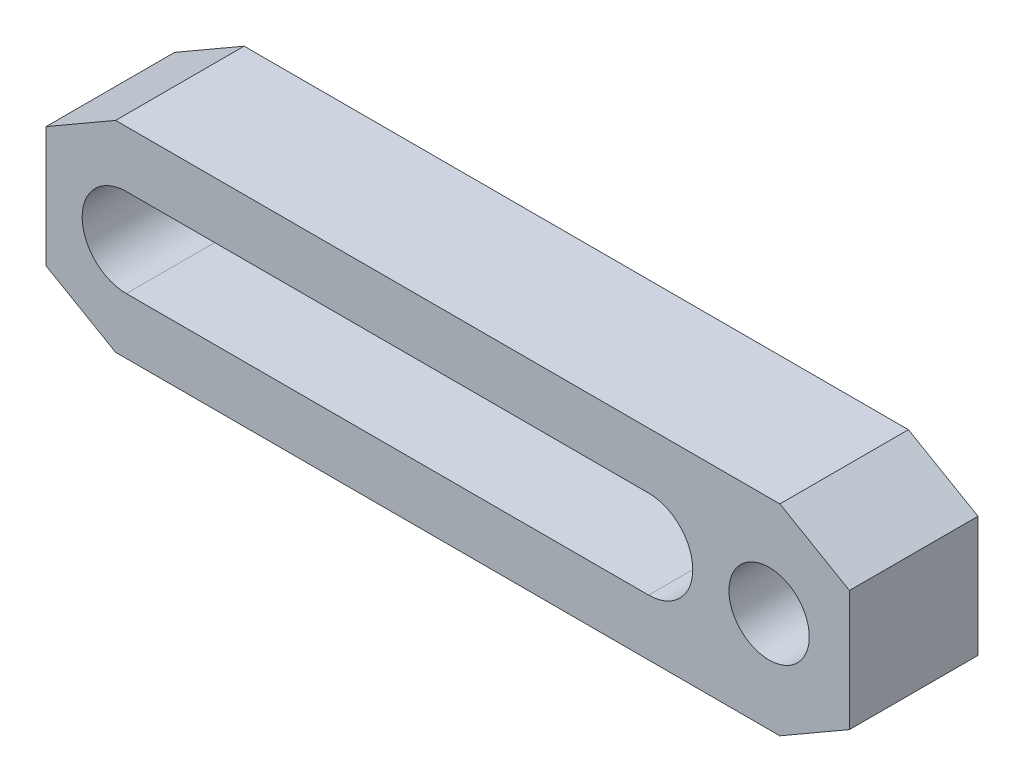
ISO-10303-21;
HEADER;
FILE_DESCRIPTION(('STEP AP214'),'2;1');
FILE_NAME('part.step','',(''),(''),'','','');
FILE_SCHEMA(('AUTOMOTIVE_DESIGN { 1 0 10303 214 1 1 1 1 }'));
ENDSEC;
DATA;
#1=APPLICATION_CONTEXT('core data for automotive mechanical design processes');
#2=APPLICATION_PROTOCOL_DEFINITION('international standard','automotive_design',2000,#1);
#3=PRODUCT_CONTEXT('',#1,'mechanical');
#4=PRODUCT('Part','Part','',(#3));
#5=PRODUCT_RELATED_PRODUCT_CATEGORY('part','',(#4));
#6=PRODUCT_DEFINITION_FORMATION('','',#4);
#7=PRODUCT_DEFINITION_CONTEXT('part definition',#1,'design');
#8=PRODUCT_DEFINITION('design','',#6,#7);
#9=PRODUCT_DEFINITION_SHAPE('','',#8);
#10=(LENGTH_UNIT() NAMED_UNIT(*) SI_UNIT(.MILLI.,.METRE.));
#11=(NAMED_UNIT(*) PLANE_ANGLE_UNIT() SI_UNIT($,.RADIAN.));
#12=(NAMED_UNIT(*) SI_UNIT($,.STERADIAN.) SOLID_ANGLE_UNIT());
#13=UNCERTAINTY_MEASURE_WITH_UNIT(LENGTH_MEASURE(1.E-05),#10,'distance_accuracy_value','');
#14=(GEOMETRIC_REPRESENTATION_CONTEXT(3) GLOBAL_UNCERTAINTY_ASSIGNED_CONTEXT((#13)) GLOBAL_UNIT_ASSIGNED_CONTEXT((#10,
#11,#12)) REPRESENTATION_CONTEXT('',''));
#15=CARTESIAN_POINT('',(0.,0.,0.));
#16=DIRECTION('',(0.,0.,1.));
#17=DIRECTION('',(1.,0.,0.));
#18=AXIS2_PLACEMENT_3D('',#15,#16,#17);
#19=CARTESIAN_POINT('',(-25.,36.3675134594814,16.));
#20=DIRECTION('',(0.,0.,1.));
#21=DIRECTION('',(0.,1.,0.));
#22=AXIS2_PLACEMENT_3D('',#19,#20,#21);
#23=PLANE('',#22);
#24=CARTESIAN_POINT('',(15.,0.,16.));
#25=DIRECTION('',(0.,0.,1.));
#26=DIRECTION('',(0.,1.,0.));
#27=AXIS2_PLACEMENT_3D('',#24,#25,#26);
#28=CIRCLE('',#27,5.);
#29=CARTESIAN_POINT('',(15.,5.,16.));
#30=VERTEX_POINT('',#29);
#31=EDGE_CURVE('E124',#30,#30,#28,.T.);
#32=ORIENTED_EDGE('',*,*,#31,.F.);
#33=EDGE_LOOP('',(#32));
#34=FACE_BOUND('',#33,.T.);
#35=DIRECTION('',(-0.866025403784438,-0.5,0.));
#36=VECTOR('',#35,1.);
#37=CARTESIAN_POINT('',(-75.,7.5,16.));
#38=LINE('',#37,#36);
#39=CARTESIAN_POINT('',(-66.3397459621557,12.5,16.));
#40=VERTEX_POINT('',#39);
#41=CARTESIAN_POINT('',(-75.,7.5,16.));
#42=VERTEX_POINT('',#41);
#43=EDGE_CURVE('E160',#40,#42,#38,.T.);
#44=ORIENTED_EDGE('',*,*,#43,.T.);
#45=DIRECTION('',(0.,-1.,0.));
#46=VECTOR('',#45,1.);
#47=CARTESIAN_POINT('',(-75.,-7.5,16.));
#48=LINE('',#47,#46);
#49=CARTESIAN_POINT('',(-75.,-7.5,16.));
#50=VERTEX_POINT('',#49);
#51=EDGE_CURVE('E163',#42,#50,#48,.T.);
#52=ORIENTED_EDGE('',*,*,#51,.T.);
#53=DIRECTION('',(0.866025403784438,-0.5,0.));
#54=VECTOR('',#53,1.);
#55=CARTESIAN_POINT('',(-75.,-7.5,16.));
#56=LINE('',#55,#54);
#57=CARTESIAN_POINT('',(-66.3397459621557,-12.5,16.));
#58=VERTEX_POINT('',#57);
#59=EDGE_CURVE('E165',#50,#58,#56,.T.);
#60=ORIENTED_EDGE('',*,*,#59,.T.);
#61=DIRECTION('',(1.,0.,0.));
#62=VECTOR('',#61,1.);
#63=CARTESIAN_POINT('',(16.3397459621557,-12.5,16.));
#64=LINE('',#63,#62);
#65=CARTESIAN_POINT('',(16.3397459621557,-12.5,16.));
#66=VERTEX_POINT('',#65);
#67=EDGE_CURVE('E167',#58,#66,#64,.T.);
#68=ORIENTED_EDGE('',*,*,#67,.T.);
#69=DIRECTION('',(0.866025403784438,0.5,0.));
#70=VECTOR('',#69,1.);
#71=CARTESIAN_POINT('',(25.,-7.5,16.));
#72=LINE('',#71,#70);
#73=CARTESIAN_POINT('',(25.,-7.5,16.));
#74=VERTEX_POINT('',#73);
#75=EDGE_CURVE('E169',#66,#74,#72,.T.);
#76=ORIENTED_EDGE('',*,*,#75,.T.);
#77=DIRECTION('',(0.,1.,0.));
#78=VECTOR('',#77,1.);
#79=CARTESIAN_POINT('',(25.,-7.5,16.));
#80=LINE('',#79,#78);
#81=CARTESIAN_POINT('',(25.,7.5,16.));
#82=VERTEX_POINT('',#81);
#83=EDGE_CURVE('E171',#74,#82,#80,.T.);
#84=ORIENTED_EDGE('',*,*,#83,.T.);
#85=DIRECTION('',(-0.866025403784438,0.5,0.));
#86=VECTOR('',#85,1.);
#87=CARTESIAN_POINT('',(25.,7.5,16.));
#88=LINE('',#87,#86);
#89=CARTESIAN_POINT('',(16.3397459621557,12.5,16.));
#90=VERTEX_POINT('',#89);
#91=EDGE_CURVE('E173',#82,#90,#88,.T.);
#92=ORIENTED_EDGE('',*,*,#91,.T.);
#93=DIRECTION('',(-1.,0.,0.));
#94=VECTOR('',#93,1.);
#95=CARTESIAN_POINT('',(16.3397459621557,12.5,16.));
#96=LINE('',#95,#94);
#97=EDGE_CURVE('E175',#90,#40,#96,.T.);
#98=ORIENTED_EDGE('',*,*,#97,.T.);
#99=EDGE_LOOP('',(#44,#52,#60,#68,#76,#84,#92,#98));
#100=FACE_BOUND('',#99,.T.);
#101=DIRECTION('',(-1.,0.,0.));
#102=VECTOR('',#101,1.);
#103=CARTESIAN_POINT('',(0.,5.5,16.));
#104=LINE('',#103,#102);
#105=CARTESIAN_POINT('',(0.,5.5,16.));
#106=VERTEX_POINT('',#105);
#107=CARTESIAN_POINT('',(-65.,5.5,16.));
#108=VERTEX_POINT('',#107);
#109=EDGE_CURVE('E134',#106,#108,#104,.T.);
#110=ORIENTED_EDGE('',*,*,#109,.F.);
#111=CARTESIAN_POINT('',(0.,0.,16.));
#112=DIRECTION('',(0.,0.,1.));
#113=DIRECTION('',(0.,1.,0.));
#114=AXIS2_PLACEMENT_3D('',#111,#112,#113);
#115=CIRCLE('',#114,5.5);
#116=CARTESIAN_POINT('',(0.,-5.5,16.));
#117=VERTEX_POINT('',#116);
#118=EDGE_CURVE('E118',#117,#106,#115,.T.);
#119=ORIENTED_EDGE('',*,*,#118,.F.);
#120=DIRECTION('',(1.,0.,0.));
#121=VECTOR('',#120,1.);
#122=CARTESIAN_POINT('',(0.,-5.5,16.));
#123=LINE('',#122,#121);
#124=CARTESIAN_POINT('',(-65.,-5.5,16.));
#125=VERTEX_POINT('',#124);
#126=EDGE_CURVE('E138',#125,#117,#123,.T.);
#127=ORIENTED_EDGE('',*,*,#126,.F.);
#128=CARTESIAN_POINT('',(-65.,0.,16.));
#129=DIRECTION('',(0.,0.,1.));
#130=DIRECTION('',(0.,1.,0.));
#131=AXIS2_PLACEMENT_3D('',#128,#129,#130);
#132=CIRCLE('',#131,5.5);
#133=EDGE_CURVE('E136',#108,#125,#132,.T.);
#134=ORIENTED_EDGE('',*,*,#133,.F.);
#135=EDGE_LOOP('',(#110,#119,#127,#134));
#136=FACE_BOUND('',#135,.T.);
#137=ADVANCED_FACE('F14',(#34,#100,#136),#23,.T.);
#138=CARTESIAN_POINT('',(-25.,36.3675134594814,0.));
#139=DIRECTION('',(0.,0.,1.));
#140=DIRECTION('',(0.,1.,0.));
#141=AXIS2_PLACEMENT_3D('',#138,#139,#140);
#142=PLANE('',#141);
#143=CARTESIAN_POINT('',(15.,0.,0.));
#144=DIRECTION('',(0.,0.,1.));
#145=DIRECTION('',(0.,1.,0.));
#146=AXIS2_PLACEMENT_3D('',#143,#144,#145);
#147=CIRCLE('',#146,5.);
#148=CARTESIAN_POINT('',(15.,5.,0.));
#149=VERTEX_POINT('',#148);
#150=EDGE_CURVE('E127',#149,#149,#147,.T.);
#151=ORIENTED_EDGE('',*,*,#150,.T.);
#152=EDGE_LOOP('',(#151));
#153=FACE_BOUND('',#152,.T.);
#154=DIRECTION('',(-0.866025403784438,-0.5,0.));
#155=VECTOR('',#154,1.);
#156=CARTESIAN_POINT('',(-75.,7.5,0.));
#157=LINE('',#156,#155);
#158=CARTESIAN_POINT('',(-66.3397459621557,12.5,0.));
#159=VERTEX_POINT('',#158);
#160=CARTESIAN_POINT('',(-75.,7.5,0.));
#161=VERTEX_POINT('',#160);
#162=EDGE_CURVE('E119',#159,#161,#157,.T.);
#163=ORIENTED_EDGE('',*,*,#162,.F.);
#164=DIRECTION('',(-1.,0.,0.));
#165=VECTOR('',#164,1.);
#166=CARTESIAN_POINT('',(16.3397459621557,12.5,0.));
#167=LINE('',#166,#165);
#168=CARTESIAN_POINT('',(16.3397459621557,12.5,0.));
#169=VERTEX_POINT('',#168);
#170=EDGE_CURVE('E158',#169,#159,#167,.T.);
#171=ORIENTED_EDGE('',*,*,#170,.F.);
#172=DIRECTION('',(-0.866025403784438,0.5,0.));
#173=VECTOR('',#172,1.);
#174=CARTESIAN_POINT('',(25.,7.5,0.));
#175=LINE('',#174,#173);
#176=CARTESIAN_POINT('',(25.,7.5,0.));
#177=VERTEX_POINT('',#176);
#178=EDGE_CURVE('E156',#177,#169,#175,.T.);
#179=ORIENTED_EDGE('',*,*,#178,.F.);
#180=DIRECTION('',(0.,1.,0.));
#181=VECTOR('',#180,1.);
#182=CARTESIAN_POINT('',(25.,-7.5,0.));
#183=LINE('',#182,#181);
#184=CARTESIAN_POINT('',(25.,-7.5,0.));
#185=VERTEX_POINT('',#184);
#186=EDGE_CURVE('E154',#185,#177,#183,.T.);
#187=ORIENTED_EDGE('',*,*,#186,.F.);
#188=DIRECTION('',(0.866025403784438,0.5,0.));
#189=VECTOR('',#188,1.);
#190=CARTESIAN_POINT('',(25.,-7.5,0.));
#191=LINE('',#190,#189);
#192=CARTESIAN_POINT('',(16.3397459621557,-12.5,0.));
#193=VERTEX_POINT('',#192);
#194=EDGE_CURVE('E152',#193,#185,#191,.T.);
#195=ORIENTED_EDGE('',*,*,#194,.F.);
#196=DIRECTION('',(1.,0.,0.));
#197=VECTOR('',#196,1.);
#198=CARTESIAN_POINT('',(16.3397459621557,-12.5,0.));
#199=LINE('',#198,#197);
#200=CARTESIAN_POINT('',(-66.3397459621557,-12.5,0.));
#201=VERTEX_POINT('',#200);
#202=EDGE_CURVE('E150',#201,#193,#199,.T.);
#203=ORIENTED_EDGE('',*,*,#202,.F.);
#204=DIRECTION('',(0.866025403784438,-0.5,0.));
#205=VECTOR('',#204,1.);
#206=CARTESIAN_POINT('',(-75.,-7.5,0.));
#207=LINE('',#206,#205);
#208=CARTESIAN_POINT('',(-75.,-7.5,0.));
#209=VERTEX_POINT('',#208);
#210=EDGE_CURVE('E148',#209,#201,#207,.T.);
#211=ORIENTED_EDGE('',*,*,#210,.F.);
#212=DIRECTION('',(0.,-1.,0.));
#213=VECTOR('',#212,1.);
#214=CARTESIAN_POINT('',(-75.,-7.5,0.));
#215=LINE('',#214,#213);
#216=EDGE_CURVE('E146',#161,#209,#215,.T.);
#217=ORIENTED_EDGE('',*,*,#216,.F.);
#218=EDGE_LOOP('',(#163,#171,#179,#187,#195,#203,#211,#217));
#219=FACE_BOUND('',#218,.T.);
#220=CARTESIAN_POINT('',(0.,0.,0.));
#221=DIRECTION('',(0.,0.,1.));
#222=DIRECTION('',(0.,1.,0.));
#223=AXIS2_PLACEMENT_3D('',#220,#221,#222);
#224=CIRCLE('',#223,5.5);
#225=CARTESIAN_POINT('',(0.,-5.5,0.));
#226=VERTEX_POINT('',#225);
#227=CARTESIAN_POINT('',(0.,5.5,0.));
#228=VERTEX_POINT('',#227);
#229=EDGE_CURVE('E37',#226,#228,#224,.T.);
#230=ORIENTED_EDGE('',*,*,#229,.T.);
#231=DIRECTION('',(-1.,0.,0.));
#232=VECTOR('',#231,1.);
#233=CARTESIAN_POINT('',(0.,5.5,0.));
#234=LINE('',#233,#232);
#235=CARTESIAN_POINT('',(-65.,5.5,0.));
#236=VERTEX_POINT('',#235);
#237=EDGE_CURVE('E105',#228,#236,#234,.T.);
#238=ORIENTED_EDGE('',*,*,#237,.T.);
#239=CARTESIAN_POINT('',(-65.,0.,0.));
#240=DIRECTION('',(0.,0.,1.));
#241=DIRECTION('',(0.,1.,0.));
#242=AXIS2_PLACEMENT_3D('',#239,#240,#241);
#243=CIRCLE('',#242,5.5);
#244=CARTESIAN_POINT('',(-65.,-5.5,0.));
#245=VERTEX_POINT('',#244);
#246=EDGE_CURVE('E114',#236,#245,#243,.T.);
#247=ORIENTED_EDGE('',*,*,#246,.T.);
#248=DIRECTION('',(1.,0.,0.));
#249=VECTOR('',#248,1.);
#250=CARTESIAN_POINT('',(0.,-5.5,0.));
#251=LINE('',#250,#249);
#252=EDGE_CURVE('E123',#245,#226,#251,.T.);
#253=ORIENTED_EDGE('',*,*,#252,.T.);
#254=EDGE_LOOP('',(#230,#238,#247,#253));
#255=FACE_BOUND('',#254,.T.);
#256=ADVANCED_FACE('F122',(#153,#219,#255),#142,.F.);
#257=CARTESIAN_POINT('',(-75.,7.5,16.));
#258=DIRECTION('',(0.5,-0.866025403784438,0.));
#259=DIRECTION('',(0.866025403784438,0.5,0.));
#260=AXIS2_PLACEMENT_3D('',#257,#258,#259);
#261=PLANE('',#260);
#262=ORIENTED_EDGE('',*,*,#162,.T.);
#263=DIRECTION('',(0.,0.,-1.));
#264=VECTOR('',#263,1.);
#265=CARTESIAN_POINT('',(-75.,7.5,16.));
#266=LINE('',#265,#264);
#267=EDGE_CURVE('E9',#42,#161,#266,.T.);
#268=ORIENTED_EDGE('',*,*,#267,.F.);
#269=ORIENTED_EDGE('',*,*,#43,.F.);
#270=DIRECTION('',(0.,0.,-1.));
#271=VECTOR('',#270,1.);
#272=CARTESIAN_POINT('',(-66.3397459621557,12.5,16.));
#273=LINE('',#272,#271);
#274=EDGE_CURVE('E177',#40,#159,#273,.T.);
#275=ORIENTED_EDGE('',*,*,#274,.T.);
#276=EDGE_LOOP('',(#262,#268,#269,#275));
#277=FACE_BOUND('',#276,.T.);
#278=ADVANCED_FACE('F16',(#277),#261,.F.);
#279=CARTESIAN_POINT('',(-75.,-7.5,16.));
#280=DIRECTION('',(1.,0.,0.));
#281=DIRECTION('',(0.,1.,0.));
#282=AXIS2_PLACEMENT_3D('',#279,#280,#281);
#283=PLANE('',#282);
#284=ORIENTED_EDGE('',*,*,#216,.T.);
#285=DIRECTION('',(0.,0.,-1.));
#286=VECTOR('',#285,1.);
#287=CARTESIAN_POINT('',(-75.,-7.5,16.));
#288=LINE('',#287,#286);
#289=EDGE_CURVE('E22',#50,#209,#288,.T.);
#290=ORIENTED_EDGE('',*,*,#289,.F.);
#291=ORIENTED_EDGE('',*,*,#51,.F.);
#292=ORIENTED_EDGE('',*,*,#267,.T.);
#293=EDGE_LOOP('',(#284,#290,#291,#292));
#294=FACE_BOUND('',#293,.T.);
#295=ADVANCED_FACE('F221',(#294),#283,.F.);
#296=CARTESIAN_POINT('',(-75.,-7.5,16.));
#297=DIRECTION('',(0.5,0.866025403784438,0.));
#298=DIRECTION('',(-0.866025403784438,0.5,0.));
#299=AXIS2_PLACEMENT_3D('',#296,#297,#298);
#300=PLANE('',#299);
#301=ORIENTED_EDGE('',*,*,#210,.T.);
#302=DIRECTION('',(0.,0.,-1.));
#303=VECTOR('',#302,1.);
#304=CARTESIAN_POINT('',(-66.3397459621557,-12.5,16.));
#305=LINE('',#304,#303);
#306=EDGE_CURVE('E192',#58,#201,#305,.T.);
#307=ORIENTED_EDGE('',*,*,#306,.F.);
#308=ORIENTED_EDGE('',*,*,#59,.F.);
#309=ORIENTED_EDGE('',*,*,#289,.T.);
#310=EDGE_LOOP('',(#301,#307,#308,#309));
#311=FACE_BOUND('',#310,.T.);
#312=ADVANCED_FACE('F199',(#311),#300,.F.);
#313=CARTESIAN_POINT('',(16.3397459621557,-12.5,16.));
#314=DIRECTION('',(0.,1.,0.));
#315=DIRECTION('',(-1.,0.,0.));
#316=AXIS2_PLACEMENT_3D('',#313,#314,#315);
#317=PLANE('',#316);
#318=ORIENTED_EDGE('',*,*,#202,.T.);
#319=DIRECTION('',(0.,0.,-1.));
#320=VECTOR('',#319,1.);
#321=CARTESIAN_POINT('',(16.3397459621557,-12.5,16.));
#322=LINE('',#321,#320);
#323=EDGE_CURVE('E189',#66,#193,#322,.T.);
#324=ORIENTED_EDGE('',*,*,#323,.F.);
#325=ORIENTED_EDGE('',*,*,#67,.F.);
#326=ORIENTED_EDGE('',*,*,#306,.T.);
#327=EDGE_LOOP('',(#318,#324,#325,#326));
#328=FACE_BOUND('',#327,.T.);
#329=ADVANCED_FACE('F209',(#328),#317,.F.);
#330=CARTESIAN_POINT('',(25.,-7.5,16.));
#331=DIRECTION('',(-0.5,0.866025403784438,0.));
#332=DIRECTION('',(-0.866025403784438,-0.5,0.));
#333=AXIS2_PLACEMENT_3D('',#330,#331,#332);
#334=PLANE('',#333);
#335=ORIENTED_EDGE('',*,*,#194,.T.);
#336=DIRECTION('',(0.,0.,-1.));
#337=VECTOR('',#336,1.);
#338=CARTESIAN_POINT('',(25.,-7.5,16.));
#339=LINE('',#338,#337);
#340=EDGE_CURVE('E186',#74,#185,#339,.T.);
#341=ORIENTED_EDGE('',*,*,#340,.F.);
#342=ORIENTED_EDGE('',*,*,#75,.F.);
#343=ORIENTED_EDGE('',*,*,#323,.T.);
#344=EDGE_LOOP('',(#335,#341,#342,#343));
#345=FACE_BOUND('',#344,.T.);
#346=ADVANCED_FACE('F213',(#345),#334,.F.);
#347=CARTESIAN_POINT('',(25.,-7.5,16.));
#348=DIRECTION('',(-1.,0.,0.));
#349=DIRECTION('',(0.,-1.,0.));
#350=AXIS2_PLACEMENT_3D('',#347,#348,#349);
#351=PLANE('',#350);
#352=ORIENTED_EDGE('',*,*,#186,.T.);
#353=DIRECTION('',(0.,0.,-1.));
#354=VECTOR('',#353,1.);
#355=CARTESIAN_POINT('',(25.,7.5,16.));
#356=LINE('',#355,#354);
#357=EDGE_CURVE('E183',#82,#177,#356,.T.);
#358=ORIENTED_EDGE('',*,*,#357,.F.);
#359=ORIENTED_EDGE('',*,*,#83,.F.);
#360=ORIENTED_EDGE('',*,*,#340,.T.);
#361=EDGE_LOOP('',(#352,#358,#359,#360));
#362=FACE_BOUND('',#361,.T.);
#363=ADVANCED_FACE('F234',(#362),#351,.F.);
#364=CARTESIAN_POINT('',(25.,7.5,16.));
#365=DIRECTION('',(-0.5,-0.866025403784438,0.));
#366=DIRECTION('',(0.866025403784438,-0.5,0.));
#367=AXIS2_PLACEMENT_3D('',#364,#365,#366);
#368=PLANE('',#367);
#369=ORIENTED_EDGE('',*,*,#178,.T.);
#370=DIRECTION('',(0.,0.,-1.));
#371=VECTOR('',#370,1.);
#372=CARTESIAN_POINT('',(16.3397459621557,12.5,16.));
#373=LINE('',#372,#371);
#374=EDGE_CURVE('E180',#90,#169,#373,.T.);
#375=ORIENTED_EDGE('',*,*,#374,.F.);
#376=ORIENTED_EDGE('',*,*,#91,.F.);
#377=ORIENTED_EDGE('',*,*,#357,.T.);
#378=EDGE_LOOP('',(#369,#375,#376,#377));
#379=FACE_BOUND('',#378,.T.);
#380=ADVANCED_FACE('F232',(#379),#368,.F.);
#381=CARTESIAN_POINT('',(16.3397459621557,12.5,16.));
#382=DIRECTION('',(0.,-1.,0.));
#383=DIRECTION('',(1.,0.,0.));
#384=AXIS2_PLACEMENT_3D('',#381,#382,#383);
#385=PLANE('',#384);
#386=ORIENTED_EDGE('',*,*,#170,.T.);
#387=ORIENTED_EDGE('',*,*,#274,.F.);
#388=ORIENTED_EDGE('',*,*,#97,.F.);
#389=ORIENTED_EDGE('',*,*,#374,.T.);
#390=EDGE_LOOP('',(#386,#387,#388,#389));
#391=FACE_BOUND('',#390,.T.);
#392=ADVANCED_FACE('F227',(#391),#385,.F.);
#393=CARTESIAN_POINT('',(0.,0.,16.));
#394=DIRECTION('',(0.,0.,-1.));
#395=DIRECTION('',(0.,-1.,0.));
#396=AXIS2_PLACEMENT_3D('',#393,#394,#395);
#397=CYLINDRICAL_SURFACE('',#396,5.5);
#398=ORIENTED_EDGE('',*,*,#229,.F.);
#399=DIRECTION('',(0.,0.,-1.));
#400=VECTOR('',#399,1.);
#401=CARTESIAN_POINT('',(0.,-5.5,16.));
#402=LINE('',#401,#400);
#403=EDGE_CURVE('E140',#117,#226,#402,.T.);
#404=ORIENTED_EDGE('',*,*,#403,.F.);
#405=ORIENTED_EDGE('',*,*,#118,.T.);
#406=DIRECTION('',(0.,0.,-1.));
#407=VECTOR('',#406,1.);
#408=CARTESIAN_POINT('',(0.,5.5,16.));
#409=LINE('',#408,#407);
#410=EDGE_CURVE('E107',#106,#228,#409,.T.);
#411=ORIENTED_EDGE('',*,*,#410,.T.);
#412=EDGE_LOOP('',(#398,#404,#405,#411));
#413=FACE_BOUND('',#412,.T.);
#414=ADVANCED_FACE('F116',(#413),#397,.F.);
#415=CARTESIAN_POINT('',(0.,5.5,16.));
#416=DIRECTION('',(0.,-1.,0.));
#417=DIRECTION('',(1.,0.,0.));
#418=AXIS2_PLACEMENT_3D('',#415,#416,#417);
#419=PLANE('',#418);
#420=ORIENTED_EDGE('',*,*,#237,.F.);
#421=ORIENTED_EDGE('',*,*,#410,.F.);
#422=ORIENTED_EDGE('',*,*,#109,.T.);
#423=DIRECTION('',(0.,0.,-1.));
#424=VECTOR('',#423,1.);
#425=CARTESIAN_POINT('',(-65.,5.5,16.));
#426=LINE('',#425,#424);
#427=EDGE_CURVE('E110',#108,#236,#426,.T.);
#428=ORIENTED_EDGE('',*,*,#427,.T.);
#429=EDGE_LOOP('',(#420,#421,#422,#428));
#430=FACE_BOUND('',#429,.T.);
#431=ADVANCED_FACE('F106',(#430),#419,.T.);
#432=CARTESIAN_POINT('',(-65.,0.,16.));
#433=DIRECTION('',(0.,0.,-1.));
#434=DIRECTION('',(0.,-1.,0.));
#435=AXIS2_PLACEMENT_3D('',#432,#433,#434);
#436=CYLINDRICAL_SURFACE('',#435,5.5);
#437=ORIENTED_EDGE('',*,*,#246,.F.);
#438=ORIENTED_EDGE('',*,*,#427,.F.);
#439=ORIENTED_EDGE('',*,*,#133,.T.);
#440=DIRECTION('',(0.,0.,-1.));
#441=VECTOR('',#440,1.);
#442=CARTESIAN_POINT('',(-65.,-5.5,16.));
#443=LINE('',#442,#441);
#444=EDGE_CURVE('E29',#125,#245,#443,.T.);
#445=ORIENTED_EDGE('',*,*,#444,.T.);
#446=EDGE_LOOP('',(#437,#438,#439,#445));
#447=FACE_BOUND('',#446,.T.);
#448=ADVANCED_FACE('F262',(#447),#436,.F.);
#449=CARTESIAN_POINT('',(0.,-5.5,16.));
#450=DIRECTION('',(0.,1.,0.));
#451=DIRECTION('',(-1.,0.,0.));
#452=AXIS2_PLACEMENT_3D('',#449,#450,#451);
#453=PLANE('',#452);
#454=ORIENTED_EDGE('',*,*,#252,.F.);
#455=ORIENTED_EDGE('',*,*,#444,.F.);
#456=ORIENTED_EDGE('',*,*,#126,.T.);
#457=ORIENTED_EDGE('',*,*,#403,.T.);
#458=EDGE_LOOP('',(#454,#455,#456,#457));
#459=FACE_BOUND('',#458,.T.);
#460=ADVANCED_FACE('F267',(#459),#453,.T.);
#461=CARTESIAN_POINT('',(15.,0.,16.));
#462=DIRECTION('',(0.,0.,1.));
#463=DIRECTION('',(0.,1.,0.));
#464=AXIS2_PLACEMENT_3D('',#461,#462,#463);
#465=CYLINDRICAL_SURFACE('',#464,5.);
#466=ORIENTED_EDGE('',*,*,#150,.F.);
#467=EDGE_LOOP('',(#466));
#468=FACE_BOUND('',#467,.T.);
#469=ORIENTED_EDGE('',*,*,#31,.T.);
#470=EDGE_LOOP('',(#469));
#471=FACE_BOUND('',#470,.T.);
#472=ADVANCED_FACE('F271',(#468,#471),#465,.F.);
#473=CLOSED_SHELL('',(#137,#256,#278,#295,#312,#329,#346,#363,#380,#392,#414,#431,#448,#460,#472));
#474=MANIFOLD_SOLID_BREP('B1',#473);
#475=ADVANCED_BREP_SHAPE_REPRESENTATION('',(#18,#474),#14);
#476=SHAPE_DEFINITION_REPRESENTATION(#9,#475);
ENDSEC;
END-ISO-10303-21;
